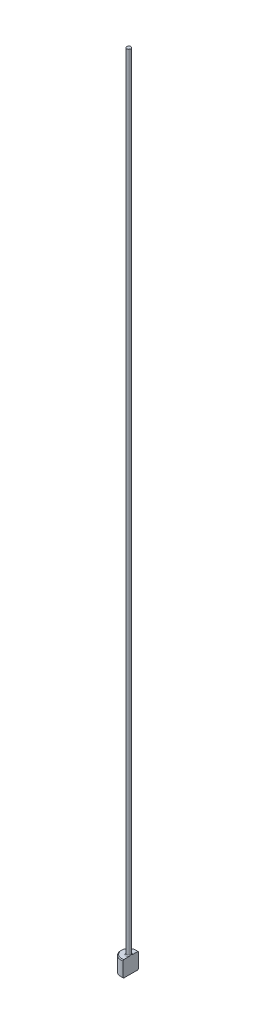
from build123d import *
from build123d.topology import SkipClean

# Parameters (mm, degrees)
CHAMFER1_SIZE    = 0.2
FILLET1_R        = 0.2
KEYED_HEAD_DEPTH = 201.019999


with BuildPart() as part:
    # Sketch1 → Revolve1 (revolve)
    with BuildSketch(Plane.XY, mode=Mode.PRIVATE) as revolve1_sk:
        Polygon((0, 0), (-2, 0), (-2, 4), (-0.5, 4), (-0.5, 200), (0, 200), align=None)
    revolve(revolve1_sk.sketch.rotate(Axis((0, 259.958771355, 0), (0, -1, 0)), 270), axis=Axis((0, 259.958771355, 0), (0, -1, 0)))

    # Chamfer1
    chamfer1_edges = [part.edges().sort_by_distance(p)[0] for p in [
        (0, 4, -2),
        (0, 0, -2),
    ]]
    chamfer(chamfer1_edges, length=CHAMFER1_SIZE)

    # Fillet1
    fillet1_edges = [part.edges().sort_by_distance(p)[0] for p in [
        (0, 4, -0.5),
    ]]
    fillet(fillet1_edges, radius=FILLET1_R)

    # Sketch2 → KEYED HEAD (cut, through all)
    with SkipClean():  # the faces are left unmerged after this step: merging them gives an invalid solid
        with BuildSketch(Plane(origin=(0, 0, 0), x_dir=(1, 0, 0), z_dir=(0, 1, 0))):
            with BuildLine():
                Line((0.5, -1.936491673), (0.5, 1.936491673))
                ThreePointArc((0.5, 1.936491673), (2, 0), (0.5, -1.936491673))
            make_face()
        extrude(amount=KEYED_HEAD_DEPTH, mode=Mode.SUBTRACT)


solid = part.part
